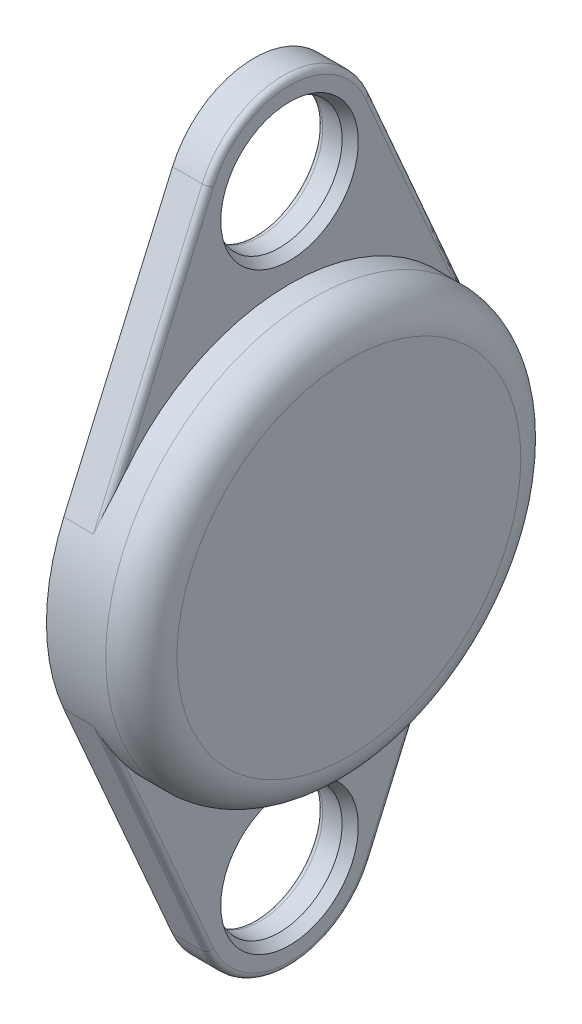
ISO-10303-21;
HEADER;
FILE_DESCRIPTION(('STEP AP214'),'2;1');
FILE_NAME('part.step','',(''),(''),'','','');
FILE_SCHEMA(('AUTOMOTIVE_DESIGN { 1 0 10303 214 1 1 1 1 }'));
ENDSEC;
DATA;
#1=APPLICATION_CONTEXT('core data for automotive mechanical design processes');
#2=APPLICATION_PROTOCOL_DEFINITION('international standard','automotive_design',2000,#1);
#3=PRODUCT_CONTEXT('',#1,'mechanical');
#4=PRODUCT('Part','Part','',(#3));
#5=PRODUCT_RELATED_PRODUCT_CATEGORY('part','',(#4));
#6=PRODUCT_DEFINITION_FORMATION('','',#4);
#7=PRODUCT_DEFINITION_CONTEXT('part definition',#1,'design');
#8=PRODUCT_DEFINITION('design','',#6,#7);
#9=PRODUCT_DEFINITION_SHAPE('','',#8);
#10=(LENGTH_UNIT() NAMED_UNIT(*) SI_UNIT(.MILLI.,.METRE.));
#11=(NAMED_UNIT(*) PLANE_ANGLE_UNIT() SI_UNIT($,.RADIAN.));
#12=(NAMED_UNIT(*) SI_UNIT($,.STERADIAN.) SOLID_ANGLE_UNIT());
#13=UNCERTAINTY_MEASURE_WITH_UNIT(LENGTH_MEASURE(1.E-05),#10,'distance_accuracy_value','');
#14=(GEOMETRIC_REPRESENTATION_CONTEXT(3) GLOBAL_UNCERTAINTY_ASSIGNED_CONTEXT((#13)) GLOBAL_UNIT_ASSIGNED_CONTEXT((#10,
#11,#12)) REPRESENTATION_CONTEXT('',''));
#15=CARTESIAN_POINT('',(0.,0.,0.));
#16=DIRECTION('',(0.,0.,1.));
#17=DIRECTION('',(1.,0.,0.));
#18=AXIS2_PLACEMENT_3D('',#15,#16,#17);
#19=CARTESIAN_POINT('',(-3.,0.,0.));
#20=DIRECTION('',(1.,0.,0.));
#21=DIRECTION('',(0.,0.,-1.));
#22=AXIS2_PLACEMENT_3D('',#19,#20,#21);
#23=TOROIDAL_SURFACE('',#22,14.5,3.);
#24=CARTESIAN_POINT('',(-3.,0.,0.));
#25=DIRECTION('',(1.,0.,0.));
#26=DIRECTION('',(0.,0.,-1.));
#27=AXIS2_PLACEMENT_3D('',#24,#25,#26);
#28=CIRCLE('',#27,17.5);
#29=CARTESIAN_POINT('',(-3.,0.,-17.5));
#30=VERTEX_POINT('',#29);
#31=EDGE_CURVE('E157',#30,#30,#28,.T.);
#32=ORIENTED_EDGE('',*,*,#31,.T.);
#33=EDGE_LOOP('',(#32));
#34=FACE_BOUND('',#33,.T.);
#35=CARTESIAN_POINT('',(0.,0.,0.));
#36=DIRECTION('',(1.,0.,0.));
#37=DIRECTION('',(0.,0.,-1.));
#38=AXIS2_PLACEMENT_3D('',#35,#36,#37);
#39=CIRCLE('',#38,14.5);
#40=CARTESIAN_POINT('',(0.,0.,-14.5));
#41=VERTEX_POINT('',#40);
#42=EDGE_CURVE('E173',#41,#41,#39,.T.);
#43=ORIENTED_EDGE('',*,*,#42,.F.);
#44=EDGE_LOOP('',(#43));
#45=FACE_BOUND('',#44,.T.);
#46=ADVANCED_FACE('F37',(#34,#45),#23,.T.);
#47=CARTESIAN_POINT('',(0.,0.,0.));
#48=DIRECTION('',(1.,0.,0.));
#49=DIRECTION('',(0.,0.,-1.));
#50=AXIS2_PLACEMENT_3D('',#47,#48,#49);
#51=PLANE('',#50);
#52=ORIENTED_EDGE('',*,*,#42,.T.);
#53=EDGE_LOOP('',(#52));
#54=FACE_BOUND('',#53,.T.);
#55=ADVANCED_FACE('F221',(#54),#51,.T.);
#56=CARTESIAN_POINT('',(0.,0.,0.));
#57=DIRECTION('',(1.,0.,0.));
#58=DIRECTION('',(0.,0.,-1.));
#59=AXIS2_PLACEMENT_3D('',#56,#57,#58);
#60=CYLINDRICAL_SURFACE('',#59,17.5);
#61=DIRECTION('',(1.,0.,0.));
#62=VECTOR('',#61,1.);
#63=CARTESIAN_POINT('',(-8.,7.,-16.0390149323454));
#64=LINE('',#63,#62);
#65=CARTESIAN_POINT('',(-8.,7.,-16.0390149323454));
#66=VERTEX_POINT('',#65);
#67=CARTESIAN_POINT('',(-5.5,7.,-16.0390149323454));
#68=VERTEX_POINT('',#67);
#69=EDGE_CURVE('E181',#66,#68,#64,.T.);
#70=ORIENTED_EDGE('',*,*,#69,.T.);
#71=CARTESIAN_POINT('',(-5.,10.6065732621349,-13.9194325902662));
#72=CARTESIAN_POINT('',(-5.00001290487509,10.5401385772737,-13.9700560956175));
#73=CARTESIAN_POINT('',(-5.00117763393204,10.4733489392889,-14.0201974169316));
#74=CARTESIAN_POINT('',(-5.0055061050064,10.3391144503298,-14.1194786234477));
#75=CARTESIAN_POINT('',(-5.00866941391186,10.2716697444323,-14.1686187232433));
#76=CARTESIAN_POINT('',(-5.02069816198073,10.0684448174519,-14.3144760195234));
#77=CARTESIAN_POINT('',(-5.03210291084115,9.9317215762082,-14.4096699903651));
#78=CARTESIAN_POINT('',(-5.06826529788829,9.57377111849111,-14.6513965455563));
#79=CARTESIAN_POINT('',(-5.0969300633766,9.35076046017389,-14.7947009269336));
#80=CARTESIAN_POINT('',(-5.16252191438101,8.899345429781,-15.0705570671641));
#81=CARTESIAN_POINT('',(-5.19945256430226,8.67093876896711,-15.2031041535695));
#82=CARTESIAN_POINT('',(-5.31778600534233,7.97788029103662,-15.5846588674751));
#83=CARTESIAN_POINT('',(-5.40672383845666,7.50543837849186,-15.8175473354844));
#84=CARTESIAN_POINT('',(-5.49706033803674,7.01593700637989,-16.0320523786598));
#85=CARTESIAN_POINT('',(-5.49853020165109,7.00796974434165,-16.035536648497));
#86=CARTESIAN_POINT('',(-5.5,7.00000000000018,-16.0390149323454));
#87=B_SPLINE_CURVE_WITH_KNOTS('',3,(#71,#72,#73,#74,#75,#76,#77,#78,#79,#80,#81,#82,#83,#84,#85,
#86),.UNSPECIFIED.,.F.,.F.,(4,2,2,2,2,2,2,4),(0.,0.250547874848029,0.501041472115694,
1.00183200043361,1.80118711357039,2.60088759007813,4.20046398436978,4.22692150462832),.UNSPECIFIED.);
#88=CARTESIAN_POINT('',(-5.,10.6065732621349,-13.9194325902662));
#89=VERTEX_POINT('',#88);
#90=EDGE_CURVE('E227',#68,#89,#87,.F.);
#91=ORIENTED_EDGE('',*,*,#90,.T.);
#92=CARTESIAN_POINT('',(-5.00000000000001,0.,0.));
#93=DIRECTION('',(1.,0.,0.));
#94=DIRECTION('',(0.,0.,-1.));
#95=AXIS2_PLACEMENT_3D('',#92,#93,#94);
#96=CIRCLE('',#95,17.5);
#97=CARTESIAN_POINT('',(-5.00000000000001,10.6065732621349,13.9194325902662));
#98=VERTEX_POINT('',#97);
#99=EDGE_CURVE('E174',#89,#98,#96,.T.);
#100=ORIENTED_EDGE('',*,*,#99,.T.);
#101=CARTESIAN_POINT('',(-5.,10.6065732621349,13.9194325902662));
#102=CARTESIAN_POINT('',(-5.00001290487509,10.5401385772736,13.9700560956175));
#103=CARTESIAN_POINT('',(-5.00117763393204,10.4733489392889,14.0201974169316));
#104=CARTESIAN_POINT('',(-5.00550610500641,10.3391144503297,14.1194786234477));
#105=CARTESIAN_POINT('',(-5.00866941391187,10.2716697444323,14.1686187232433));
#106=CARTESIAN_POINT('',(-5.02069816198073,10.0684448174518,14.3144760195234));
#107=CARTESIAN_POINT('',(-5.03210291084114,9.93172157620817,14.4096699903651));
#108=CARTESIAN_POINT('',(-5.06826529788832,9.57377111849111,14.6513965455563));
#109=CARTESIAN_POINT('',(-5.09693006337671,9.3507604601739,14.7947009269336));
#110=CARTESIAN_POINT('',(-5.16252191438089,8.89934542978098,15.0705570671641));
#111=CARTESIAN_POINT('',(-5.19945256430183,8.67093876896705,15.2031041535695));
#112=CARTESIAN_POINT('',(-5.3177860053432,7.97788029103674,15.5846588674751));
#113=CARTESIAN_POINT('',(-5.4067238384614,7.50543837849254,15.8175473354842));
#114=CARTESIAN_POINT('',(-5.4970603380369,7.01593700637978,16.0320523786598));
#115=CARTESIAN_POINT('',(-5.49853020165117,7.00796974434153,16.0355366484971));
#116=CARTESIAN_POINT('',(-5.5,7.00000000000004,16.0390149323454));
#117=B_SPLINE_CURVE_WITH_KNOTS('',3,(#101,#102,#103,#104,#105,#106,#107,#108,#109,#110,#111,
#112,#113,#114,#115,#116),.UNSPECIFIED.,.F.,.F.,(4,2,2,2,2,2,2,4),(0.,0.250547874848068,
0.501041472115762,1.00183200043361,1.8011871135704,2.6008875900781,4.20046398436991,
4.22692150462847),.UNSPECIFIED.);
#118=CARTESIAN_POINT('',(-5.5,7.,16.0390149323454));
#119=VERTEX_POINT('',#118);
#120=EDGE_CURVE('E156',#98,#119,#117,.T.);
#121=ORIENTED_EDGE('',*,*,#120,.T.);
#122=DIRECTION('',(1.,0.,0.));
#123=VECTOR('',#122,1.);
#124=CARTESIAN_POINT('',(-8.,7.,16.0390149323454));
#125=LINE('',#124,#123);
#126=CARTESIAN_POINT('',(-8.,7.,16.0390149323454));
#127=VERTEX_POINT('',#126);
#128=EDGE_CURVE('E135',#127,#119,#125,.T.);
#129=ORIENTED_EDGE('',*,*,#128,.F.);
#130=CARTESIAN_POINT('',(-8.,0.,0.));
#131=DIRECTION('',(-1.,0.,0.));
#132=DIRECTION('',(0.,0.,1.));
#133=AXIS2_PLACEMENT_3D('',#130,#131,#132);
#134=CIRCLE('',#133,17.5);
#135=CARTESIAN_POINT('',(-8.,-7.00000000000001,16.0390149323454));
#136=VERTEX_POINT('',#135);
#137=EDGE_CURVE('E142',#136,#127,#134,.T.);
#138=ORIENTED_EDGE('',*,*,#137,.F.);
#139=DIRECTION('',(1.,0.,0.));
#140=VECTOR('',#139,1.);
#141=CARTESIAN_POINT('',(-8.,-7.00000000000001,16.0390149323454));
#142=LINE('',#141,#140);
#143=CARTESIAN_POINT('',(-5.5,-7.00000000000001,16.0390149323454));
#144=VERTEX_POINT('',#143);
#145=EDGE_CURVE('E486',#136,#144,#142,.T.);
#146=ORIENTED_EDGE('',*,*,#145,.T.);
#147=CARTESIAN_POINT('',(-5.,-10.6065732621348,13.9194325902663));
#148=CARTESIAN_POINT('',(-5.0000129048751,-10.5401385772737,13.9700560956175));
#149=CARTESIAN_POINT('',(-5.00117763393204,-10.473348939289,14.0201974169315));
#150=CARTESIAN_POINT('',(-5.00550610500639,-10.33911445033,14.1194786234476));
#151=CARTESIAN_POINT('',(-5.00866941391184,-10.2716697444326,14.1686187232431));
#152=CARTESIAN_POINT('',(-5.02069816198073,-10.0684448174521,14.3144760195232));
#153=CARTESIAN_POINT('',(-5.03210291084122,-9.93172157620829,14.409669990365));
#154=CARTESIAN_POINT('',(-5.06826529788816,-9.57377111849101,14.6513965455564));
#155=CARTESIAN_POINT('',(-5.09693006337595,-9.35076046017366,14.7947009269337));
#156=CARTESIAN_POINT('',(-5.16252191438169,-8.8993454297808,15.0705570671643));
#157=CARTESIAN_POINT('',(-5.19945256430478,-8.67093876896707,15.2031041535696));
#158=CARTESIAN_POINT('',(-5.31778600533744,-7.97788029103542,15.5846588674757));
#159=CARTESIAN_POINT('',(-5.40672383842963,-7.50543837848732,15.8175473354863));
#160=CARTESIAN_POINT('',(-5.49706033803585,-7.01593700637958,16.0320523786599));
#161=CARTESIAN_POINT('',(-5.49853020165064,-7.00796974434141,16.0355366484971));
#162=CARTESIAN_POINT('',(-5.5,-7.00000000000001,16.0390149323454));
#163=B_SPLINE_CURVE_WITH_KNOTS('',3,(#147,#148,#149,#150,#151,#152,#153,#154,#155,#156,#157,
#158,#159,#160,#161,#162),.UNSPECIFIED.,.F.,.F.,(4,2,2,2,2,2,2,4),(0.,0.250547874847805,
0.501041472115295,1.00183200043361,1.80118711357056,2.60088759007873,4.20046398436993,
4.22692150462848),.UNSPECIFIED.);
#164=CARTESIAN_POINT('',(-5.00000000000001,-10.6065732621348,13.9194325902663));
#165=VERTEX_POINT('',#164);
#166=EDGE_CURVE('E206',#144,#165,#163,.F.);
#167=ORIENTED_EDGE('',*,*,#166,.T.);
#168=CARTESIAN_POINT('',(-5.,-10.6065732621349,-13.9194325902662));
#169=VERTEX_POINT('',#168);
#170=EDGE_CURVE('E160',#165,#169,#96,.T.);
#171=ORIENTED_EDGE('',*,*,#170,.T.);
#172=CARTESIAN_POINT('',(-5.,-10.6065732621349,-13.9194325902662));
#173=CARTESIAN_POINT('',(-5.0000129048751,-10.5401385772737,-13.9700560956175));
#174=CARTESIAN_POINT('',(-5.00117763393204,-10.4733489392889,-14.0201974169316));
#175=CARTESIAN_POINT('',(-5.0055061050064,-10.3391144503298,-14.1194786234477));
#176=CARTESIAN_POINT('',(-5.00866941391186,-10.2716697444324,-14.1686187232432));
#177=CARTESIAN_POINT('',(-5.02069816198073,-10.0684448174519,-14.3144760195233));
#178=CARTESIAN_POINT('',(-5.03210291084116,-9.93172157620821,-14.4096699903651));
#179=CARTESIAN_POINT('',(-5.06826529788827,-9.57377111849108,-14.6513965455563));
#180=CARTESIAN_POINT('',(-5.0969300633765,-9.35076046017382,-14.7947009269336));
#181=CARTESIAN_POINT('',(-5.16252191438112,-8.89934542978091,-15.0705570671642));
#182=CARTESIAN_POINT('',(-5.19945256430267,-8.67093876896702,-15.2031041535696));
#183=CARTESIAN_POINT('',(-5.31778600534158,-7.97788029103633,-15.5846588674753));
#184=CARTESIAN_POINT('',(-5.40672383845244,-7.50543837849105,-15.8175473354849));
#185=CARTESIAN_POINT('',(-5.49706033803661,-7.01593700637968,-16.0320523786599));
#186=CARTESIAN_POINT('',(-5.49853020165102,-7.00796974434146,-16.0355366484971));
#187=CARTESIAN_POINT('',(-5.5,-7.00000000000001,-16.0390149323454));
#188=B_SPLINE_CURVE_WITH_KNOTS('',3,(#172,#173,#174,#175,#176,#177,#178,#179,#180,#181,#182,
#183,#184,#185,#186,#187),.UNSPECIFIED.,.F.,.F.,(4,2,2,2,2,2,2,4),(0.,0.250547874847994,
0.501041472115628,1.00183200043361,1.80118711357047,2.60088759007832,4.20046398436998,
4.22692150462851),.UNSPECIFIED.);
#189=CARTESIAN_POINT('',(-5.5,-7.,-16.0390149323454));
#190=VERTEX_POINT('',#189);
#191=EDGE_CURVE('E52',#169,#190,#188,.T.);
#192=ORIENTED_EDGE('',*,*,#191,.T.);
#193=DIRECTION('',(1.,0.,0.));
#194=VECTOR('',#193,1.);
#195=CARTESIAN_POINT('',(-8.,-7.,-16.0390149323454));
#196=LINE('',#195,#194);
#197=CARTESIAN_POINT('',(-8.,-7.,-16.0390149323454));
#198=VERTEX_POINT('',#197);
#199=EDGE_CURVE('E493',#198,#190,#196,.T.);
#200=ORIENTED_EDGE('',*,*,#199,.F.);
#201=CARTESIAN_POINT('',(-8.,0.,0.));
#202=DIRECTION('',(-1.,0.,0.));
#203=DIRECTION('',(0.,0.,1.));
#204=AXIS2_PLACEMENT_3D('',#201,#202,#203);
#205=CIRCLE('',#204,17.5);
#206=EDGE_CURVE('E477',#66,#198,#205,.T.);
#207=ORIENTED_EDGE('',*,*,#206,.F.);
#208=EDGE_LOOP('',(#70,#91,#100,#121,#129,#138,#146,#167,#171,#192,#200,#207));
#209=FACE_BOUND('',#208,.T.);
#210=ORIENTED_EDGE('',*,*,#31,.F.);
#211=EDGE_LOOP('',(#210));
#212=FACE_BOUND('',#211,.T.);
#213=ADVANCED_FACE('F152',(#209,#212),#60,.T.);
#214=CARTESIAN_POINT('',(-5.,0.,0.));
#215=DIRECTION('',(-1.,0.,0.));
#216=DIRECTION('',(0.,0.,1.));
#217=AXIS2_PLACEMENT_3D('',#214,#215,#216);
#218=PLANE('',#217);
#219=CARTESIAN_POINT('',(-5.,25.,0.));
#220=DIRECTION('',(-1.,0.,0.));
#221=DIRECTION('',(0.,0.,1.));
#222=AXIS2_PLACEMENT_3D('',#219,#220,#221);
#223=CIRCLE('',#222,5.79999999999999);
#224=CARTESIAN_POINT('',(-5.,25.,5.79999999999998));
#225=VERTEX_POINT('',#224);
#226=EDGE_CURVE('E523',#225,#225,#223,.T.);
#227=ORIENTED_EDGE('',*,*,#226,.T.);
#228=EDGE_LOOP('',(#227));
#229=FACE_BOUND('',#228,.T.);
#230=CARTESIAN_POINT('',(-5.,25.,0.));
#231=DIRECTION('',(-1.,0.,0.));
#232=DIRECTION('',(0.,0.,1.));
#233=AXIS2_PLACEMENT_3D('',#230,#231,#232);
#234=CIRCLE('',#233,7.);
#235=CARTESIAN_POINT('',(-5.,27.8,-6.41560597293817));
#236=VERTEX_POINT('',#235);
#237=CARTESIAN_POINT('',(-5.,27.8,6.41560597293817));
#238=VERTEX_POINT('',#237);
#239=EDGE_CURVE('E508',#236,#238,#234,.F.);
#240=ORIENTED_EDGE('',*,*,#239,.T.);
#241=DIRECTION('',(0.,0.916515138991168,-0.4));
#242=VECTOR('',#241,1.);
#243=CARTESIAN_POINT('',(-5.,6.8,15.5807573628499));
#244=LINE('',#243,#242);
#245=EDGE_CURVE('E468',#238,#98,#244,.F.);
#246=ORIENTED_EDGE('',*,*,#245,.T.);
#247=ORIENTED_EDGE('',*,*,#99,.F.);
#248=DIRECTION('',(0.,-0.916515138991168,-0.4));
#249=VECTOR('',#248,1.);
#250=CARTESIAN_POINT('',(-5.,6.8,-15.5807573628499));
#251=LINE('',#250,#249);
#252=EDGE_CURVE('E172',#89,#236,#251,.F.);
#253=ORIENTED_EDGE('',*,*,#252,.T.);
#254=EDGE_LOOP('',(#240,#246,#247,#253));
#255=FACE_BOUND('',#254,.T.);
#256=ADVANCED_FACE('F220',(#229,#255),#218,.F.);
#257=CARTESIAN_POINT('',(-8.,0.,0.));
#258=DIRECTION('',(-1.,0.,0.));
#259=DIRECTION('',(0.,0.,1.));
#260=AXIS2_PLACEMENT_3D('',#257,#258,#259);
#261=PLANE('',#260);
#262=CARTESIAN_POINT('',(-8.,25.,0.));
#263=DIRECTION('',(-1.,0.,0.));
#264=DIRECTION('',(0.,0.,1.));
#265=AXIS2_PLACEMENT_3D('',#262,#263,#264);
#266=CIRCLE('',#265,5.8);
#267=CARTESIAN_POINT('',(-8.,25.,5.8));
#268=VERTEX_POINT('',#267);
#269=EDGE_CURVE('E45',#268,#268,#266,.F.);
#270=ORIENTED_EDGE('',*,*,#269,.T.);
#271=EDGE_LOOP('',(#270));
#272=FACE_BOUND('',#271,.T.);
#273=CARTESIAN_POINT('',(-8.,-25.,0.));
#274=DIRECTION('',(-1.,0.,0.));
#275=DIRECTION('',(0.,0.,1.));
#276=AXIS2_PLACEMENT_3D('',#273,#274,#275);
#277=CIRCLE('',#276,5.8);
#278=CARTESIAN_POINT('',(-8.,-25.,5.8));
#279=VERTEX_POINT('',#278);
#280=EDGE_CURVE('E538',#279,#279,#277,.F.);
#281=ORIENTED_EDGE('',*,*,#280,.T.);
#282=EDGE_LOOP('',(#281));
#283=FACE_BOUND('',#282,.T.);
#284=ORIENTED_EDGE('',*,*,#137,.T.);
#285=DIRECTION('',(0.,0.916515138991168,-0.4));
#286=VECTOR('',#285,1.);
#287=CARTESIAN_POINT('',(-8.,28.,6.87386354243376));
#288=LINE('',#287,#286);
#289=CARTESIAN_POINT('',(-8.,28.,6.87386354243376));
#290=VERTEX_POINT('',#289);
#291=EDGE_CURVE('E130',#127,#290,#288,.T.);
#292=ORIENTED_EDGE('',*,*,#291,.T.);
#293=CARTESIAN_POINT('',(-8.,25.,0.));
#294=DIRECTION('',(-1.,0.,0.));
#295=DIRECTION('',(0.,0.,1.));
#296=AXIS2_PLACEMENT_3D('',#293,#294,#295);
#297=CIRCLE('',#296,7.5);
#298=CARTESIAN_POINT('',(-8.,28.,-6.87386354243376));
#299=VERTEX_POINT('',#298);
#300=EDGE_CURVE('E141',#290,#299,#297,.T.);
#301=ORIENTED_EDGE('',*,*,#300,.T.);
#302=DIRECTION('',(0.,-0.916515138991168,-0.4));
#303=VECTOR('',#302,1.);
#304=CARTESIAN_POINT('',(-8.,28.,-6.87386354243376));
#305=LINE('',#304,#303);
#306=EDGE_CURVE('E475',#299,#66,#305,.T.);
#307=ORIENTED_EDGE('',*,*,#306,.T.);
#308=ORIENTED_EDGE('',*,*,#206,.T.);
#309=DIRECTION('',(0.,-0.916515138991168,0.4));
#310=VECTOR('',#309,1.);
#311=CARTESIAN_POINT('',(-8.,-7.00000000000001,-16.0390149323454));
#312=LINE('',#311,#310);
#313=CARTESIAN_POINT('',(-8.,-28.,-6.87386354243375));
#314=VERTEX_POINT('',#313);
#315=EDGE_CURVE('E481',#198,#314,#312,.T.);
#316=ORIENTED_EDGE('',*,*,#315,.T.);
#317=CARTESIAN_POINT('',(-8.,-25.,0.));
#318=DIRECTION('',(-1.,0.,0.));
#319=DIRECTION('',(0.,0.,1.));
#320=AXIS2_PLACEMENT_3D('',#317,#318,#319);
#321=CIRCLE('',#320,7.5);
#322=CARTESIAN_POINT('',(-8.,-28.,6.87386354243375));
#323=VERTEX_POINT('',#322);
#324=EDGE_CURVE('E483',#314,#323,#321,.T.);
#325=ORIENTED_EDGE('',*,*,#324,.T.);
#326=DIRECTION('',(0.,0.916515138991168,0.4));
#327=VECTOR('',#326,1.);
#328=CARTESIAN_POINT('',(-8.,-7.00000000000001,16.0390149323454));
#329=LINE('',#328,#327);
#330=EDGE_CURVE('E147',#323,#136,#329,.T.);
#331=ORIENTED_EDGE('',*,*,#330,.T.);
#332=EDGE_LOOP('',(#284,#292,#301,#307,#308,#316,#325,#331));
#333=FACE_BOUND('',#332,.T.);
#334=ADVANCED_FACE('F145',(#272,#283,#333),#261,.T.);
#335=CARTESIAN_POINT('',(-5.,-25.,0.));
#336=DIRECTION('',(-1.,0.,0.));
#337=DIRECTION('',(0.,0.,1.));
#338=AXIS2_PLACEMENT_3D('',#335,#336,#337);
#339=CIRCLE('',#338,5.79999999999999);
#340=CARTESIAN_POINT('',(-5.,-25.,5.79999999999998));
#341=VERTEX_POINT('',#340);
#342=EDGE_CURVE('E529',#341,#341,#339,.T.);
#343=ORIENTED_EDGE('',*,*,#342,.T.);
#344=EDGE_LOOP('',(#343));
#345=FACE_BOUND('',#344,.T.);
#346=ORIENTED_EDGE('',*,*,#170,.F.);
#347=DIRECTION('',(0.,0.916515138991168,0.400000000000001));
#348=VECTOR('',#347,1.);
#349=CARTESIAN_POINT('',(-5.,-6.80000000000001,15.5807573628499));
#350=LINE('',#349,#348);
#351=CARTESIAN_POINT('',(-5.,-27.8,6.41560597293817));
#352=VERTEX_POINT('',#351);
#353=EDGE_CURVE('E193',#165,#352,#350,.F.);
#354=ORIENTED_EDGE('',*,*,#353,.T.);
#355=CARTESIAN_POINT('',(-5.,-25.,0.));
#356=DIRECTION('',(-1.,0.,0.));
#357=DIRECTION('',(0.,0.,1.));
#358=AXIS2_PLACEMENT_3D('',#355,#356,#357);
#359=CIRCLE('',#358,7.);
#360=CARTESIAN_POINT('',(-5.,-27.8,-6.41560597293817));
#361=VERTEX_POINT('',#360);
#362=EDGE_CURVE('E191',#352,#361,#359,.F.);
#363=ORIENTED_EDGE('',*,*,#362,.T.);
#364=DIRECTION('',(0.,-0.916515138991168,0.4));
#365=VECTOR('',#364,1.);
#366=CARTESIAN_POINT('',(-5.,-6.80000000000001,-15.5807573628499));
#367=LINE('',#366,#365);
#368=EDGE_CURVE('E189',#361,#169,#367,.F.);
#369=ORIENTED_EDGE('',*,*,#368,.T.);
#370=EDGE_LOOP('',(#346,#354,#363,#369));
#371=FACE_BOUND('',#370,.T.);
#372=ADVANCED_FACE('F297',(#345,#371),#218,.F.);
#373=CARTESIAN_POINT('',(-8.,28.,6.87386354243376));
#374=DIRECTION('',(0.,-0.4,-0.916515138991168));
#375=DIRECTION('',(0.,0.916515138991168,-0.4));
#376=AXIS2_PLACEMENT_3D('',#373,#374,#375);
#377=PLANE('',#376);
#378=ORIENTED_EDGE('',*,*,#128,.T.);
#379=DIRECTION('',(0.,0.916515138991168,-0.4));
#380=VECTOR('',#379,1.);
#381=CARTESIAN_POINT('',(-5.5,28.,6.87386354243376));
#382=LINE('',#381,#380);
#383=CARTESIAN_POINT('',(-5.5,28.,6.87386354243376));
#384=VERTEX_POINT('',#383);
#385=EDGE_CURVE('E170',#119,#384,#382,.T.);
#386=ORIENTED_EDGE('',*,*,#385,.T.);
#387=DIRECTION('',(1.,0.,0.));
#388=VECTOR('',#387,1.);
#389=CARTESIAN_POINT('',(-8.,28.,6.87386354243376));
#390=LINE('',#389,#388);
#391=EDGE_CURVE('E138',#290,#384,#390,.T.);
#392=ORIENTED_EDGE('',*,*,#391,.F.);
#393=ORIENTED_EDGE('',*,*,#291,.F.);
#394=EDGE_LOOP('',(#378,#386,#392,#393));
#395=FACE_BOUND('',#394,.T.);
#396=ADVANCED_FACE('F132',(#395),#377,.F.);
#397=CARTESIAN_POINT('',(-8.,25.,0.));
#398=DIRECTION('',(1.,0.,0.));
#399=DIRECTION('',(0.,0.,-1.));
#400=AXIS2_PLACEMENT_3D('',#397,#398,#399);
#401=CYLINDRICAL_SURFACE('',#400,7.5);
#402=ORIENTED_EDGE('',*,*,#391,.T.);
#403=CARTESIAN_POINT('',(-5.5,25.,0.));
#404=DIRECTION('',(-1.,0.,0.));
#405=DIRECTION('',(0.,0.,1.));
#406=AXIS2_PLACEMENT_3D('',#403,#404,#405);
#407=CIRCLE('',#406,7.5);
#408=CARTESIAN_POINT('',(-5.5,28.,-6.87386354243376));
#409=VERTEX_POINT('',#408);
#410=EDGE_CURVE('E473',#384,#409,#407,.T.);
#411=ORIENTED_EDGE('',*,*,#410,.T.);
#412=DIRECTION('',(1.,0.,0.));
#413=VECTOR('',#412,1.);
#414=CARTESIAN_POINT('',(-8.,28.,-6.87386354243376));
#415=LINE('',#414,#413);
#416=EDGE_CURVE('E162',#299,#409,#415,.T.);
#417=ORIENTED_EDGE('',*,*,#416,.F.);
#418=ORIENTED_EDGE('',*,*,#300,.F.);
#419=EDGE_LOOP('',(#402,#411,#417,#418));
#420=FACE_BOUND('',#419,.T.);
#421=ADVANCED_FACE('F319',(#420),#401,.T.);
#422=CARTESIAN_POINT('',(-8.,28.,-6.87386354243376));
#423=DIRECTION('',(0.,-0.4,0.916515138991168));
#424=DIRECTION('',(0.,-0.916515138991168,-0.4));
#425=AXIS2_PLACEMENT_3D('',#422,#423,#424);
#426=PLANE('',#425);
#427=ORIENTED_EDGE('',*,*,#416,.T.);
#428=DIRECTION('',(0.,-0.916515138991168,-0.4));
#429=VECTOR('',#428,1.);
#430=CARTESIAN_POINT('',(-5.5,28.,-6.87386354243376));
#431=LINE('',#430,#429);
#432=EDGE_CURVE('E60',#409,#68,#431,.T.);
#433=ORIENTED_EDGE('',*,*,#432,.T.);
#434=ORIENTED_EDGE('',*,*,#69,.F.);
#435=ORIENTED_EDGE('',*,*,#306,.F.);
#436=EDGE_LOOP('',(#427,#433,#434,#435));
#437=FACE_BOUND('',#436,.T.);
#438=ADVANCED_FACE('F325',(#437),#426,.F.);
#439=CARTESIAN_POINT('',(-8.,-7.00000000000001,-16.0390149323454));
#440=DIRECTION('',(0.,0.4,0.916515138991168));
#441=DIRECTION('',(0.,-0.916515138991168,0.4));
#442=AXIS2_PLACEMENT_3D('',#439,#440,#441);
#443=PLANE('',#442);
#444=ORIENTED_EDGE('',*,*,#199,.T.);
#445=DIRECTION('',(0.,-0.916515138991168,0.4));
#446=VECTOR('',#445,1.);
#447=CARTESIAN_POINT('',(-5.5,-7.00000000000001,-16.0390149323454));
#448=LINE('',#447,#446);
#449=CARTESIAN_POINT('',(-5.5,-28.,-6.87386354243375));
#450=VERTEX_POINT('',#449);
#451=EDGE_CURVE('E198',#190,#450,#448,.T.);
#452=ORIENTED_EDGE('',*,*,#451,.T.);
#453=DIRECTION('',(1.,0.,0.));
#454=VECTOR('',#453,1.);
#455=CARTESIAN_POINT('',(-8.,-28.,-6.87386354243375));
#456=LINE('',#455,#454);
#457=EDGE_CURVE('E490',#314,#450,#456,.T.);
#458=ORIENTED_EDGE('',*,*,#457,.F.);
#459=ORIENTED_EDGE('',*,*,#315,.F.);
#460=EDGE_LOOP('',(#444,#452,#458,#459));
#461=FACE_BOUND('',#460,.T.);
#462=ADVANCED_FACE('F332',(#461),#443,.F.);
#463=CARTESIAN_POINT('',(-8.,-25.,0.));
#464=DIRECTION('',(1.,0.,0.));
#465=DIRECTION('',(0.,0.,-1.));
#466=AXIS2_PLACEMENT_3D('',#463,#464,#465);
#467=CYLINDRICAL_SURFACE('',#466,7.5);
#468=ORIENTED_EDGE('',*,*,#457,.T.);
#469=CARTESIAN_POINT('',(-5.5,-25.,0.));
#470=DIRECTION('',(-1.,0.,0.));
#471=DIRECTION('',(0.,0.,1.));
#472=AXIS2_PLACEMENT_3D('',#469,#470,#471);
#473=CIRCLE('',#472,7.5);
#474=CARTESIAN_POINT('',(-5.5,-28.,6.87386354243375));
#475=VERTEX_POINT('',#474);
#476=EDGE_CURVE('E195',#450,#475,#473,.T.);
#477=ORIENTED_EDGE('',*,*,#476,.T.);
#478=DIRECTION('',(1.,0.,0.));
#479=VECTOR('',#478,1.);
#480=CARTESIAN_POINT('',(-8.,-28.,6.87386354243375));
#481=LINE('',#480,#479);
#482=EDGE_CURVE('E487',#323,#475,#481,.T.);
#483=ORIENTED_EDGE('',*,*,#482,.F.);
#484=ORIENTED_EDGE('',*,*,#324,.F.);
#485=EDGE_LOOP('',(#468,#477,#483,#484));
#486=FACE_BOUND('',#485,.T.);
#487=ADVANCED_FACE('F339',(#486),#467,.T.);
#488=CARTESIAN_POINT('',(-8.,-7.00000000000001,16.0390149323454));
#489=DIRECTION('',(0.,0.4,-0.916515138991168));
#490=DIRECTION('',(0.,0.916515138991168,0.400000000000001));
#491=AXIS2_PLACEMENT_3D('',#488,#489,#490);
#492=PLANE('',#491);
#493=ORIENTED_EDGE('',*,*,#482,.T.);
#494=DIRECTION('',(0.,0.916515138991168,0.400000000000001));
#495=VECTOR('',#494,1.);
#496=CARTESIAN_POINT('',(-5.5,-7.00000000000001,16.0390149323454));
#497=LINE('',#496,#495);
#498=EDGE_CURVE('E187',#475,#144,#497,.T.);
#499=ORIENTED_EDGE('',*,*,#498,.T.);
#500=ORIENTED_EDGE('',*,*,#145,.F.);
#501=ORIENTED_EDGE('',*,*,#330,.F.);
#502=EDGE_LOOP('',(#493,#499,#500,#501));
#503=FACE_BOUND('',#502,.T.);
#504=ADVANCED_FACE('F347',(#503),#492,.F.);
#505=CARTESIAN_POINT('',(-8.,25.,0.));
#506=DIRECTION('',(1.,0.,0.));
#507=DIRECTION('',(0.,0.,-1.));
#508=AXIS2_PLACEMENT_3D('',#505,#506,#507);
#509=CYLINDRICAL_SURFACE('',#508,5.3);
#510=CARTESIAN_POINT('',(-7.5,25.,0.));
#511=DIRECTION('',(-1.,0.,0.));
#512=DIRECTION('',(0.,0.,1.));
#513=AXIS2_PLACEMENT_3D('',#510,#511,#512);
#514=CIRCLE('',#513,5.3);
#515=CARTESIAN_POINT('',(-7.5,25.,5.3));
#516=VERTEX_POINT('',#515);
#517=EDGE_CURVE('E535',#516,#516,#514,.T.);
#518=ORIENTED_EDGE('',*,*,#517,.T.);
#519=EDGE_LOOP('',(#518));
#520=FACE_BOUND('',#519,.T.);
#521=CARTESIAN_POINT('',(-5.86602540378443,25.,0.));
#522=DIRECTION('',(-1.,0.,0.));
#523=DIRECTION('',(0.,0.,1.));
#524=AXIS2_PLACEMENT_3D('',#521,#522,#523);
#525=CIRCLE('',#524,5.3);
#526=CARTESIAN_POINT('',(-5.86602540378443,25.,5.3));
#527=VERTEX_POINT('',#526);
#528=EDGE_CURVE('E526',#527,#527,#525,.F.);
#529=ORIENTED_EDGE('',*,*,#528,.T.);
#530=EDGE_LOOP('',(#529));
#531=FACE_BOUND('',#530,.T.);
#532=ADVANCED_FACE('F355',(#520,#531),#509,.F.);
#533=CARTESIAN_POINT('',(-8.,-25.,0.));
#534=DIRECTION('',(1.,0.,0.));
#535=DIRECTION('',(0.,0.,-1.));
#536=AXIS2_PLACEMENT_3D('',#533,#534,#535);
#537=CYLINDRICAL_SURFACE('',#536,5.3);
#538=CARTESIAN_POINT('',(-7.5,-25.,0.));
#539=DIRECTION('',(-1.,0.,0.));
#540=DIRECTION('',(0.,0.,1.));
#541=AXIS2_PLACEMENT_3D('',#538,#539,#540);
#542=CIRCLE('',#541,5.3);
#543=CARTESIAN_POINT('',(-7.5,-25.,5.3));
#544=VERTEX_POINT('',#543);
#545=EDGE_CURVE('E11',#544,#544,#542,.T.);
#546=ORIENTED_EDGE('',*,*,#545,.T.);
#547=EDGE_LOOP('',(#546));
#548=FACE_BOUND('',#547,.T.);
#549=CARTESIAN_POINT('',(-5.86602540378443,-25.,0.));
#550=DIRECTION('',(-1.,0.,0.));
#551=DIRECTION('',(0.,0.,1.));
#552=AXIS2_PLACEMENT_3D('',#549,#550,#551);
#553=CIRCLE('',#552,5.3);
#554=CARTESIAN_POINT('',(-5.86602540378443,-25.,5.3));
#555=VERTEX_POINT('',#554);
#556=EDGE_CURVE('E532',#555,#555,#553,.F.);
#557=ORIENTED_EDGE('',*,*,#556,.T.);
#558=EDGE_LOOP('',(#557));
#559=FACE_BOUND('',#558,.T.);
#560=ADVANCED_FACE('F241',(#548,#559),#537,.F.);
#561=CARTESIAN_POINT('',(-5.5,27.8,-6.41560597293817));
#562=DIRECTION('',(0.,-0.916515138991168,-0.4));
#563=DIRECTION('',(0.,0.4,-0.916515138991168));
#564=AXIS2_PLACEMENT_3D('',#561,#562,#563);
#565=CYLINDRICAL_SURFACE('',#564,0.5);
#566=ORIENTED_EDGE('',*,*,#90,.F.);
#567=ORIENTED_EDGE('',*,*,#432,.F.);
#568=CARTESIAN_POINT('',(-5.5,27.8,-6.41560597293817));
#569=DIRECTION('',(0.,0.916515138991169,0.399999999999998));
#570=DIRECTION('',(0.,-0.399999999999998,0.916515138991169));
#571=AXIS2_PLACEMENT_3D('',#568,#569,#570);
#572=CIRCLE('',#571,0.5);
#573=EDGE_CURVE('E150',#236,#409,#572,.T.);
#574=ORIENTED_EDGE('',*,*,#573,.F.);
#575=ORIENTED_EDGE('',*,*,#252,.F.);
#576=EDGE_LOOP('',(#566,#567,#574,#575));
#577=FACE_BOUND('',#576,.T.);
#578=ADVANCED_FACE('F237',(#577),#565,.T.);
#579=CARTESIAN_POINT('',(-5.5,25.,0.));
#580=DIRECTION('',(-1.,0.,0.));
#581=DIRECTION('',(0.,0.,1.));
#582=AXIS2_PLACEMENT_3D('',#579,#580,#581);
#583=TOROIDAL_SURFACE('',#582,7.,0.5);
#584=ORIENTED_EDGE('',*,*,#573,.T.);
#585=ORIENTED_EDGE('',*,*,#410,.F.);
#586=CARTESIAN_POINT('',(-5.5,27.8,6.41560597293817));
#587=DIRECTION('',(0.,-0.916515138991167,0.400000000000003));
#588=DIRECTION('',(0.,-0.400000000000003,-0.916515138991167));
#589=AXIS2_PLACEMENT_3D('',#586,#587,#588);
#590=CIRCLE('',#589,0.5);
#591=EDGE_CURVE('E470',#238,#384,#590,.T.);
#592=ORIENTED_EDGE('',*,*,#591,.F.);
#593=ORIENTED_EDGE('',*,*,#239,.F.);
#594=EDGE_LOOP('',(#584,#585,#592,#593));
#595=FACE_BOUND('',#594,.T.);
#596=ADVANCED_FACE('F240',(#595),#583,.T.);
#597=CARTESIAN_POINT('',(-5.5,27.8,6.41560597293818));
#598=DIRECTION('',(0.,0.916515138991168,-0.4));
#599=DIRECTION('',(0.,0.4,0.916515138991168));
#600=AXIS2_PLACEMENT_3D('',#597,#598,#599);
#601=CYLINDRICAL_SURFACE('',#600,0.5);
#602=ORIENTED_EDGE('',*,*,#120,.F.);
#603=ORIENTED_EDGE('',*,*,#245,.F.);
#604=ORIENTED_EDGE('',*,*,#591,.T.);
#605=ORIENTED_EDGE('',*,*,#385,.F.);
#606=EDGE_LOOP('',(#602,#603,#604,#605));
#607=FACE_BOUND('',#606,.T.);
#608=ADVANCED_FACE('F212',(#607),#601,.T.);
#609=CARTESIAN_POINT('',(-5.5,-6.80000000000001,-15.5807573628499));
#610=DIRECTION('',(0.,-0.916515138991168,0.4));
#611=DIRECTION('',(0.,-0.4,-0.916515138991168));
#612=AXIS2_PLACEMENT_3D('',#609,#610,#611);
#613=CYLINDRICAL_SURFACE('',#612,0.5);
#614=ORIENTED_EDGE('',*,*,#191,.F.);
#615=ORIENTED_EDGE('',*,*,#368,.F.);
#616=CARTESIAN_POINT('',(-5.5,-27.8,-6.41560597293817));
#617=DIRECTION('',(0.,-0.916515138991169,0.399999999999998));
#618=DIRECTION('',(0.,-0.399999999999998,-0.916515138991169));
#619=AXIS2_PLACEMENT_3D('',#616,#617,#618);
#620=CIRCLE('',#619,0.5);
#621=EDGE_CURVE('E517',#450,#361,#620,.T.);
#622=ORIENTED_EDGE('',*,*,#621,.F.);
#623=ORIENTED_EDGE('',*,*,#451,.F.);
#624=EDGE_LOOP('',(#614,#615,#622,#623));
#625=FACE_BOUND('',#624,.T.);
#626=ADVANCED_FACE('F251',(#625),#613,.T.);
#627=CARTESIAN_POINT('',(-5.5,-25.,0.));
#628=DIRECTION('',(-1.,0.,0.));
#629=DIRECTION('',(0.,0.,1.));
#630=AXIS2_PLACEMENT_3D('',#627,#628,#629);
#631=TOROIDAL_SURFACE('',#630,7.,0.5);
#632=ORIENTED_EDGE('',*,*,#621,.T.);
#633=ORIENTED_EDGE('',*,*,#362,.F.);
#634=CARTESIAN_POINT('',(-5.5,-27.8,6.41560597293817));
#635=DIRECTION('',(0.,0.916515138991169,0.399999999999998));
#636=DIRECTION('',(0.,-0.399999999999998,0.916515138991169));
#637=AXIS2_PLACEMENT_3D('',#634,#635,#636);
#638=CIRCLE('',#637,0.5);
#639=EDGE_CURVE('E519',#475,#352,#638,.T.);
#640=ORIENTED_EDGE('',*,*,#639,.F.);
#641=ORIENTED_EDGE('',*,*,#476,.F.);
#642=EDGE_LOOP('',(#632,#633,#640,#641));
#643=FACE_BOUND('',#642,.T.);
#644=ADVANCED_FACE('F248',(#643),#631,.T.);
#645=CARTESIAN_POINT('',(-5.5,-6.80000000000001,15.5807573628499));
#646=DIRECTION('',(0.,0.916515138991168,0.400000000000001));
#647=DIRECTION('',(0.,-0.4,0.916515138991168));
#648=AXIS2_PLACEMENT_3D('',#645,#646,#647);
#649=CYLINDRICAL_SURFACE('',#648,0.5);
#650=ORIENTED_EDGE('',*,*,#639,.T.);
#651=ORIENTED_EDGE('',*,*,#353,.F.);
#652=ORIENTED_EDGE('',*,*,#166,.F.);
#653=ORIENTED_EDGE('',*,*,#498,.F.);
#654=EDGE_LOOP('',(#650,#651,#652,#653));
#655=FACE_BOUND('',#654,.T.);
#656=ADVANCED_FACE('F243',(#655),#649,.T.);
#657=CARTESIAN_POINT('',(-5.,25.,0.));
#658=DIRECTION('',(1.,0.,0.));
#659=DIRECTION('',(0.,0.,-1.));
#660=AXIS2_PLACEMENT_3D('',#657,#658,#659);
#661=CONICAL_SURFACE('',#660,5.79999999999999,0.523598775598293);
#662=ORIENTED_EDGE('',*,*,#528,.F.);
#663=EDGE_LOOP('',(#662));
#664=FACE_BOUND('',#663,.T.);
#665=ORIENTED_EDGE('',*,*,#226,.F.);
#666=EDGE_LOOP('',(#665));
#667=FACE_BOUND('',#666,.T.);
#668=ADVANCED_FACE('F247',(#664,#667),#661,.F.);
#669=CARTESIAN_POINT('',(-5.,-25.,0.));
#670=DIRECTION('',(1.,0.,0.));
#671=DIRECTION('',(0.,0.,-1.));
#672=AXIS2_PLACEMENT_3D('',#669,#670,#671);
#673=CONICAL_SURFACE('',#672,5.79999999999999,0.523598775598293);
#674=ORIENTED_EDGE('',*,*,#556,.F.);
#675=EDGE_LOOP('',(#674));
#676=FACE_BOUND('',#675,.T.);
#677=ORIENTED_EDGE('',*,*,#342,.F.);
#678=EDGE_LOOP('',(#677));
#679=FACE_BOUND('',#678,.T.);
#680=ADVANCED_FACE('F259',(#676,#679),#673,.F.);
#681=CARTESIAN_POINT('',(-7.5,25.,0.));
#682=DIRECTION('',(-1.,0.,0.));
#683=DIRECTION('',(0.,0.,1.));
#684=AXIS2_PLACEMENT_3D('',#681,#682,#683);
#685=TOROIDAL_SURFACE('',#684,5.8,0.5);
#686=ORIENTED_EDGE('',*,*,#269,.F.);
#687=EDGE_LOOP('',(#686));
#688=FACE_BOUND('',#687,.T.);
#689=ORIENTED_EDGE('',*,*,#517,.F.);
#690=EDGE_LOOP('',(#689));
#691=FACE_BOUND('',#690,.T.);
#692=ADVANCED_FACE('F262',(#688,#691),#685,.T.);
#693=CARTESIAN_POINT('',(-7.5,-25.,0.));
#694=DIRECTION('',(-1.,0.,0.));
#695=DIRECTION('',(0.,0.,1.));
#696=AXIS2_PLACEMENT_3D('',#693,#694,#695);
#697=TOROIDAL_SURFACE('',#696,5.8,0.5);
#698=ORIENTED_EDGE('',*,*,#280,.F.);
#699=EDGE_LOOP('',(#698));
#700=FACE_BOUND('',#699,.T.);
#701=ORIENTED_EDGE('',*,*,#545,.F.);
#702=EDGE_LOOP('',(#701));
#703=FACE_BOUND('',#702,.T.);
#704=ADVANCED_FACE('F39',(#700,#703),#697,.T.);
#705=CLOSED_SHELL('',(#46,#55,#213,#256,#334,#372,#396,#421,#438,#462,#487,#504,#532,#560,#578,
#596,#608,#626,#644,#656,#668,#680,#692,#704));
#706=MANIFOLD_SOLID_BREP('B2',#705);
#707=ADVANCED_BREP_SHAPE_REPRESENTATION('',(#18,#706),#14);
#708=SHAPE_DEFINITION_REPRESENTATION(#9,#707);
ENDSEC;
END-ISO-10303-21;
